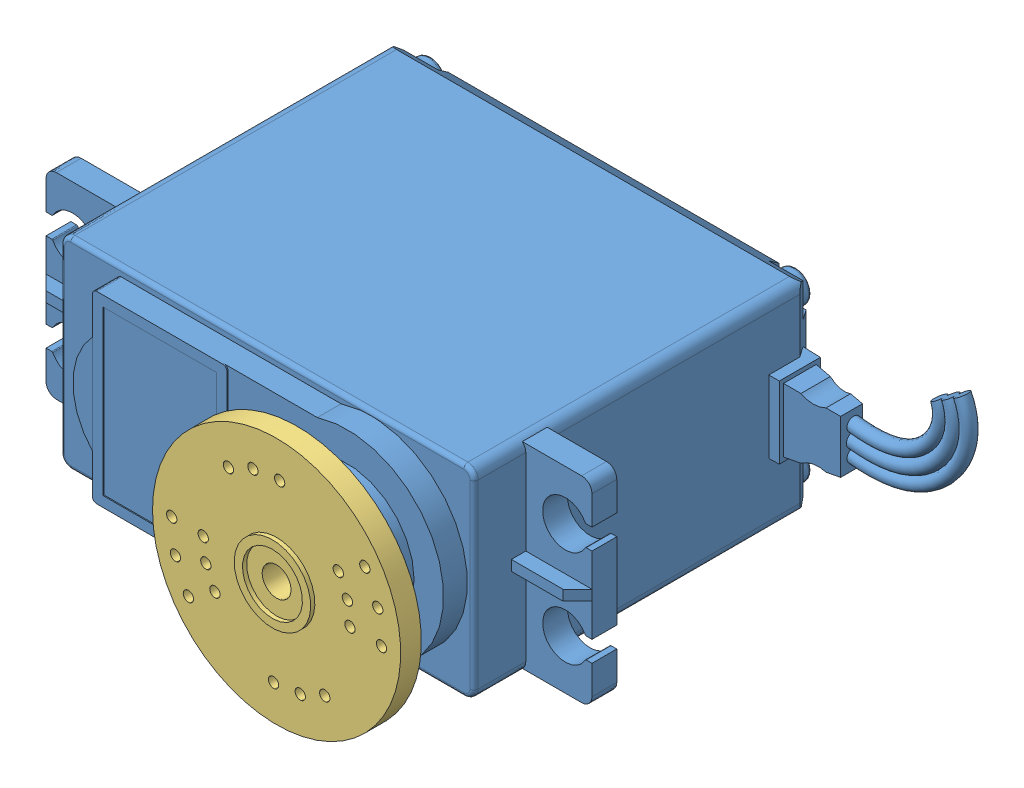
SolidWorks assembly HS422_Assemblé.SLDASM, configuration Défaut (file format 4400). Lengths in mm.
Overall size (64.18 29.52 43.05).
3 component instances, 3 part files, 5 mates.
Components (placement in the parent):
- corps_HS422-1: corps_HS422.SLDPRT [Défaut] at (-19.2808 3.2298 -18.7251) size (64.18 19.5 37.55)
- axe_HS422-1: axe_HS422.SLDPRT [Défaut] at (-9.2808 3.2298 18.2749) x (0.266065 -0.963955 0) z (0 0 1) size (6 6 3.6)
- palonnier_HS422-1: palonnier_HS422.SLDPRT [Défaut] at (-9.2808 3.2298 22.5749) x (-0.266065 0.963955 0) z (0 0 -1) size (24 24 4.9)
Mates (geometry in assembly coordinates):
- Coïncidente1: coincident anti-aligned: plane of axe_HS422-1 through (-9.2808 3.2298 21.8749) normal (0 0 1); plane of palonnier_HS422-1 through (-9.2808 3.2298 21.8749) normal (0 0 -1)
- Coaxiale1: concentric anti-aligned: cylinder of axe_HS422-1 through (-9.2808 3.2298 18.7749) axis (0 0 -1) radius 3; cylinder of palonnier_HS422-1 through (-9.2808 3.2298 19.3749) axis (0 0 1) radius 1.4
- Coïncidente2: coincident aligned: plane of axe_HS422-1; plane of palonnier_HS422-1
- Coaxiale2: concentric anti-aligned: cylinder of corps_HS422-1 through (-9.2808 3.2298 17.7749) axis (0 0 1) radius 3; cylinder of axe_HS422-1 through (-9.2808 3.2298 18.7749) axis (0 0 -1) radius 3
- Coïncidente3: coincident aligned: plane of corps_HS422-1 through (-9.2808 3.2298 18.7749) normal (0 0 1); circle of axe_HS422-1
